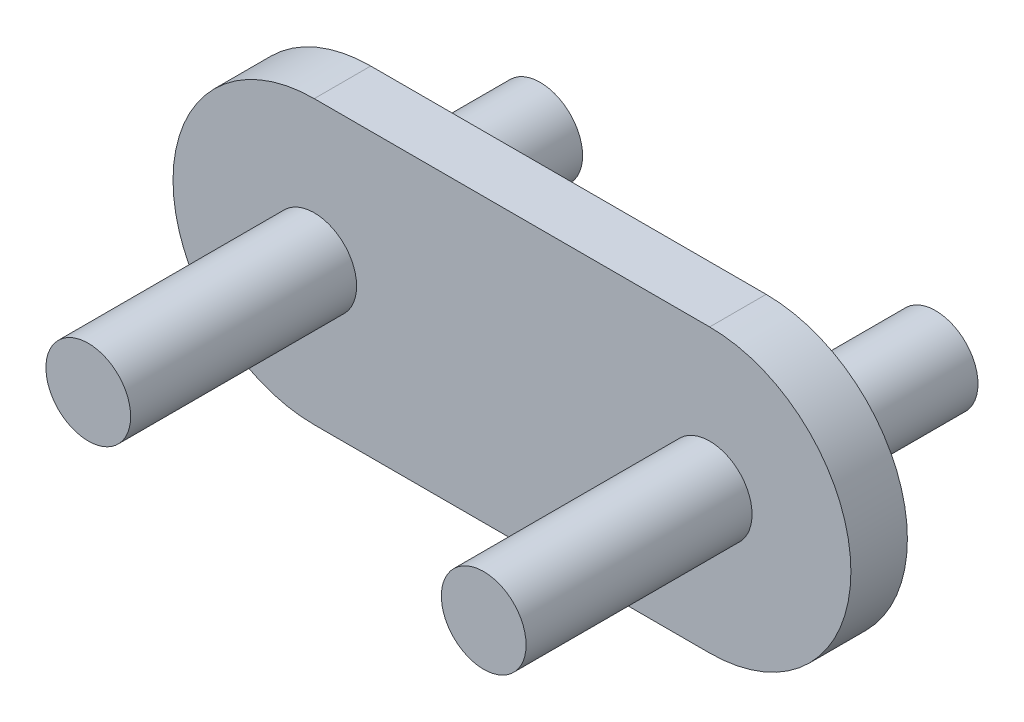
from build123d import *

# Parameters (mm, degrees)
SKETCH1_R      = 7.5
EXTRUDE1_DEPTH = 10
SKETCH3_R      = 7.5
EXTRUDE2_DEPTH = 40


with BuildPart() as part:
    # Sketch1 → Extrude1 (new body)
    with BuildSketch(Plane.XY):
        with BuildLine():
            Line((0, 25), (-70, 25))
            ThreePointArc((-70, 25), (-95, 0), (-70, -25))
            Line((-70, -25), (0, -25))
            ThreePointArc((0, -25), (25, 0), (0, 25))
        make_face()
        with Locations((-70, 0)):
            Circle(SKETCH1_R, mode=Mode.SUBTRACT)
        Circle(SKETCH1_R, mode=Mode.SUBTRACT)
    extrude(amount=EXTRUDE1_DEPTH)

    # Sketch3 → Extrude2 (add, symmetric)
    with BuildSketch(Plane.XY.offset(10)):
        Circle(SKETCH3_R)
        with Locations((-70, 0)):
            Circle(SKETCH3_R)
    extrude(amount=EXTRUDE2_DEPTH, both=True)


solid = part.part
